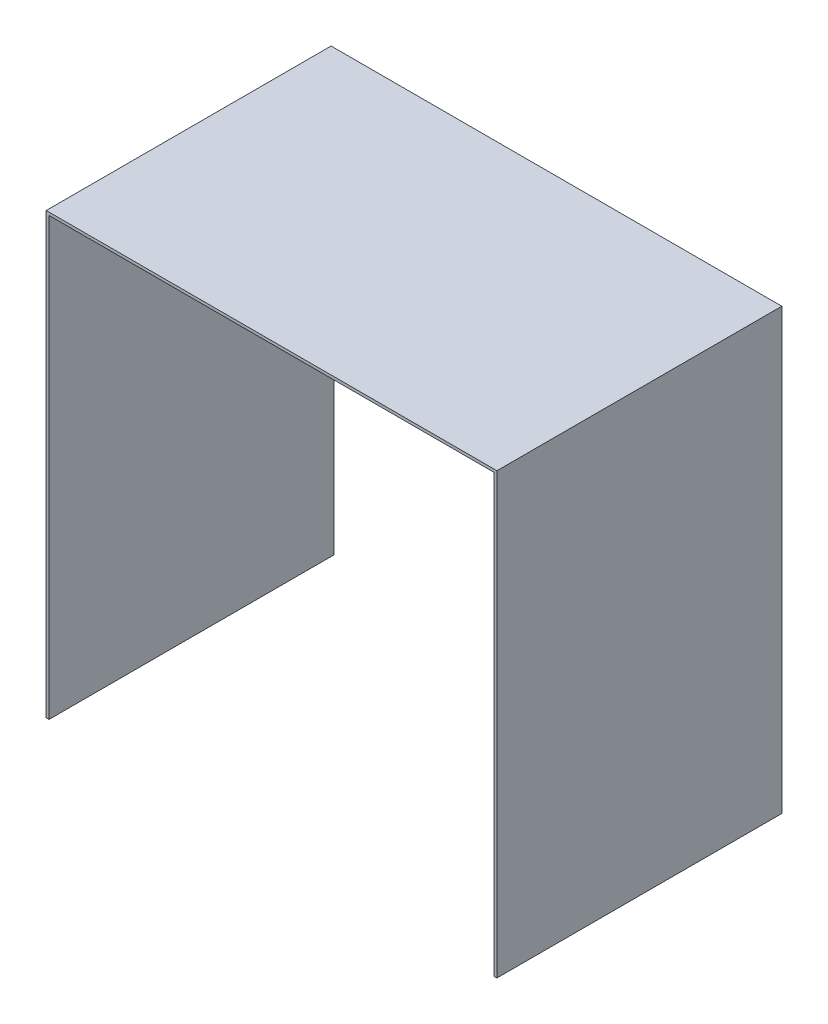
ISO-10303-21;
HEADER;
FILE_DESCRIPTION(('STEP AP214'),'2;1');
FILE_NAME('part.step','',(''),(''),'','','');
FILE_SCHEMA(('AUTOMOTIVE_DESIGN { 1 0 10303 214 1 1 1 1 }'));
ENDSEC;
DATA;
#1=APPLICATION_CONTEXT('core data for automotive mechanical design processes');
#2=APPLICATION_PROTOCOL_DEFINITION('international standard','automotive_design',2000,#1);
#3=PRODUCT_CONTEXT('',#1,'mechanical');
#4=PRODUCT('Part','Part','',(#3));
#5=PRODUCT_RELATED_PRODUCT_CATEGORY('part','',(#4));
#6=PRODUCT_DEFINITION_FORMATION('','',#4);
#7=PRODUCT_DEFINITION_CONTEXT('part definition',#1,'design');
#8=PRODUCT_DEFINITION('design','',#6,#7);
#9=PRODUCT_DEFINITION_SHAPE('','',#8);
#10=(LENGTH_UNIT() NAMED_UNIT(*) SI_UNIT(.MILLI.,.METRE.));
#11=(NAMED_UNIT(*) PLANE_ANGLE_UNIT() SI_UNIT($,.RADIAN.));
#12=(NAMED_UNIT(*) SI_UNIT($,.STERADIAN.) SOLID_ANGLE_UNIT());
#13=UNCERTAINTY_MEASURE_WITH_UNIT(LENGTH_MEASURE(1.E-05),#10,'distance_accuracy_value','');
#14=(GEOMETRIC_REPRESENTATION_CONTEXT(3) GLOBAL_UNCERTAINTY_ASSIGNED_CONTEXT((#13)) GLOBAL_UNIT_ASSIGNED_CONTEXT((#10,
#11,#12)) REPRESENTATION_CONTEXT('',''));
#15=CARTESIAN_POINT('',(0.,0.,0.));
#16=DIRECTION('',(0.,0.,1.));
#17=DIRECTION('',(1.,0.,0.));
#18=AXIS2_PLACEMENT_3D('',#15,#16,#17);
#19=CARTESIAN_POINT('',(-10.,0.,1000.));
#20=DIRECTION('',(1.,0.,0.));
#21=DIRECTION('',(0.,0.,-1.));
#22=AXIS2_PLACEMENT_3D('',#19,#20,#21);
#23=PLANE('',#22);
#24=DIRECTION('',(0.,1.,0.));
#25=VECTOR('',#24,1.);
#26=CARTESIAN_POINT('',(-10.,0.,0.));
#27=LINE('',#26,#25);
#28=CARTESIAN_POINT('',(-10.,1542.,0.));
#29=VERTEX_POINT('',#28);
#30=CARTESIAN_POINT('',(-10.,0.,0.));
#31=VERTEX_POINT('',#30);
#32=EDGE_CURVE('E106',#29,#31,#27,.F.);
#33=ORIENTED_EDGE('',*,*,#32,.T.);
#34=DIRECTION('',(0.,0.,-1.));
#35=VECTOR('',#34,1.);
#36=CARTESIAN_POINT('',(-10.,0.,1000.));
#37=LINE('',#36,#35);
#38=CARTESIAN_POINT('',(-10.,0.,1000.));
#39=VERTEX_POINT('',#38);
#40=EDGE_CURVE('E11',#39,#31,#37,.T.);
#41=ORIENTED_EDGE('',*,*,#40,.F.);
#42=DIRECTION('',(0.,1.,0.));
#43=VECTOR('',#42,1.);
#44=CARTESIAN_POINT('',(-10.,0.,1000.));
#45=LINE('',#44,#43);
#46=CARTESIAN_POINT('',(-10.,1542.,1000.));
#47=VERTEX_POINT('',#46);
#48=EDGE_CURVE('E130',#47,#39,#45,.F.);
#49=ORIENTED_EDGE('',*,*,#48,.F.);
#50=DIRECTION('',(0.,0.,-1.));
#51=VECTOR('',#50,1.);
#52=CARTESIAN_POINT('',(-10.,1542.,1000.));
#53=LINE('',#52,#51);
#54=EDGE_CURVE('E107',#47,#29,#53,.T.);
#55=ORIENTED_EDGE('',*,*,#54,.T.);
#56=EDGE_LOOP('',(#33,#41,#49,#55));
#57=FACE_BOUND('',#56,.T.);
#58=ADVANCED_FACE('F31',(#57),#23,.F.);
#59=CARTESIAN_POINT('',(0.,0.,1000.));
#60=DIRECTION('',(0.,-1.,0.));
#61=DIRECTION('',(0.,0.,-1.));
#62=AXIS2_PLACEMENT_3D('',#59,#60,#61);
#63=PLANE('',#62);
#64=DIRECTION('',(-1.,0.,0.));
#65=VECTOR('',#64,1.);
#66=CARTESIAN_POINT('',(0.,0.,0.));
#67=LINE('',#66,#65);
#68=CARTESIAN_POINT('',(0.,0.,0.));
#69=VERTEX_POINT('',#68);
#70=EDGE_CURVE('E98',#69,#31,#67,.T.);
#71=ORIENTED_EDGE('',*,*,#70,.F.);
#72=DIRECTION('',(0.,0.,-1.));
#73=VECTOR('',#72,1.);
#74=CARTESIAN_POINT('',(0.,0.,1000.));
#75=LINE('',#74,#73);
#76=CARTESIAN_POINT('',(0.,0.,1000.));
#77=VERTEX_POINT('',#76);
#78=EDGE_CURVE('E38',#77,#69,#75,.T.);
#79=ORIENTED_EDGE('',*,*,#78,.F.);
#80=DIRECTION('',(-1.,0.,0.));
#81=VECTOR('',#80,1.);
#82=CARTESIAN_POINT('',(0.,0.,1000.));
#83=LINE('',#82,#81);
#84=EDGE_CURVE('E101',#77,#39,#83,.T.);
#85=ORIENTED_EDGE('',*,*,#84,.T.);
#86=ORIENTED_EDGE('',*,*,#40,.T.);
#87=EDGE_LOOP('',(#71,#79,#85,#86));
#88=FACE_BOUND('',#87,.T.);
#89=ADVANCED_FACE('F96',(#88),#63,.T.);
#90=CARTESIAN_POINT('',(0.,0.,1000.));
#91=DIRECTION('',(1.,0.,0.));
#92=DIRECTION('',(0.,0.,-1.));
#93=AXIS2_PLACEMENT_3D('',#90,#91,#92);
#94=PLANE('',#93);
#95=DIRECTION('',(0.,-1.,0.));
#96=VECTOR('',#95,1.);
#97=CARTESIAN_POINT('',(0.,0.,0.));
#98=LINE('',#97,#96);
#99=CARTESIAN_POINT('',(0.,1532.,0.));
#100=VERTEX_POINT('',#99);
#101=EDGE_CURVE('E114',#100,#69,#98,.T.);
#102=ORIENTED_EDGE('',*,*,#101,.F.);
#103=DIRECTION('',(0.,0.,-1.));
#104=VECTOR('',#103,1.);
#105=CARTESIAN_POINT('',(0.,1532.,1000.));
#106=LINE('',#105,#104);
#107=CARTESIAN_POINT('',(0.,1532.,1000.));
#108=VERTEX_POINT('',#107);
#109=EDGE_CURVE('E157',#108,#100,#106,.T.);
#110=ORIENTED_EDGE('',*,*,#109,.F.);
#111=DIRECTION('',(0.,-1.,0.));
#112=VECTOR('',#111,1.);
#113=CARTESIAN_POINT('',(0.,0.,1000.));
#114=LINE('',#113,#112);
#115=EDGE_CURVE('E133',#108,#77,#114,.T.);
#116=ORIENTED_EDGE('',*,*,#115,.T.);
#117=ORIENTED_EDGE('',*,*,#78,.T.);
#118=EDGE_LOOP('',(#102,#110,#116,#117));
#119=FACE_BOUND('',#118,.T.);
#120=ADVANCED_FACE('F159',(#119),#94,.T.);
#121=CARTESIAN_POINT('',(0.,1532.,1000.));
#122=DIRECTION('',(0.,-1.,0.));
#123=DIRECTION('',(0.,0.,-1.));
#124=AXIS2_PLACEMENT_3D('',#121,#122,#123);
#125=PLANE('',#124);
#126=DIRECTION('',(-1.,0.,0.));
#127=VECTOR('',#126,1.);
#128=CARTESIAN_POINT('',(0.,1532.,0.));
#129=LINE('',#128,#127);
#130=CARTESIAN_POINT('',(1562.,1532.,0.));
#131=VERTEX_POINT('',#130);
#132=EDGE_CURVE('E116',#131,#100,#129,.T.);
#133=ORIENTED_EDGE('',*,*,#132,.F.);
#134=DIRECTION('',(0.,0.,-1.));
#135=VECTOR('',#134,1.);
#136=CARTESIAN_POINT('',(1562.,1532.,1000.));
#137=LINE('',#136,#135);
#138=CARTESIAN_POINT('',(1562.,1532.,1000.));
#139=VERTEX_POINT('',#138);
#140=EDGE_CURVE('E155',#139,#131,#137,.T.);
#141=ORIENTED_EDGE('',*,*,#140,.F.);
#142=DIRECTION('',(-1.,0.,0.));
#143=VECTOR('',#142,1.);
#144=CARTESIAN_POINT('',(0.,1532.,1000.));
#145=LINE('',#144,#143);
#146=EDGE_CURVE('E136',#139,#108,#145,.T.);
#147=ORIENTED_EDGE('',*,*,#146,.T.);
#148=ORIENTED_EDGE('',*,*,#109,.T.);
#149=EDGE_LOOP('',(#133,#141,#147,#148));
#150=FACE_BOUND('',#149,.T.);
#151=ADVANCED_FACE('F166',(#150),#125,.T.);
#152=CARTESIAN_POINT('',(1562.,0.,1000.));
#153=DIRECTION('',(-1.,0.,0.));
#154=DIRECTION('',(0.,0.,1.));
#155=AXIS2_PLACEMENT_3D('',#152,#153,#154);
#156=PLANE('',#155);
#157=DIRECTION('',(0.,1.,0.));
#158=VECTOR('',#157,1.);
#159=CARTESIAN_POINT('',(1562.,0.,0.));
#160=LINE('',#159,#158);
#161=CARTESIAN_POINT('',(1562.,0.,0.));
#162=VERTEX_POINT('',#161);
#163=EDGE_CURVE('E120',#162,#131,#160,.T.);
#164=ORIENTED_EDGE('',*,*,#163,.F.);
#165=DIRECTION('',(0.,0.,-1.));
#166=VECTOR('',#165,1.);
#167=CARTESIAN_POINT('',(1562.,0.,1000.));
#168=LINE('',#167,#166);
#169=CARTESIAN_POINT('',(1562.,0.,1000.));
#170=VERTEX_POINT('',#169);
#171=EDGE_CURVE('E153',#170,#162,#168,.T.);
#172=ORIENTED_EDGE('',*,*,#171,.F.);
#173=DIRECTION('',(0.,1.,0.));
#174=VECTOR('',#173,1.);
#175=CARTESIAN_POINT('',(1562.,0.,1000.));
#176=LINE('',#175,#174);
#177=EDGE_CURVE('E139',#170,#139,#176,.T.);
#178=ORIENTED_EDGE('',*,*,#177,.T.);
#179=ORIENTED_EDGE('',*,*,#140,.T.);
#180=EDGE_LOOP('',(#164,#172,#178,#179));
#181=FACE_BOUND('',#180,.T.);
#182=ADVANCED_FACE('F169',(#181),#156,.T.);
#183=CARTESIAN_POINT('',(1572.,0.,1000.));
#184=DIRECTION('',(0.,-1.,0.));
#185=DIRECTION('',(0.,0.,-1.));
#186=AXIS2_PLACEMENT_3D('',#183,#184,#185);
#187=PLANE('',#186);
#188=DIRECTION('',(-1.,0.,0.));
#189=VECTOR('',#188,1.);
#190=CARTESIAN_POINT('',(1572.,0.,0.));
#191=LINE('',#190,#189);
#192=CARTESIAN_POINT('',(1572.,0.,0.));
#193=VERTEX_POINT('',#192);
#194=EDGE_CURVE('E123',#193,#162,#191,.T.);
#195=ORIENTED_EDGE('',*,*,#194,.F.);
#196=DIRECTION('',(0.,0.,-1.));
#197=VECTOR('',#196,1.);
#198=CARTESIAN_POINT('',(1572.,0.,1000.));
#199=LINE('',#198,#197);
#200=CARTESIAN_POINT('',(1572.,0.,1000.));
#201=VERTEX_POINT('',#200);
#202=EDGE_CURVE('E151',#201,#193,#199,.T.);
#203=ORIENTED_EDGE('',*,*,#202,.F.);
#204=DIRECTION('',(-1.,0.,0.));
#205=VECTOR('',#204,1.);
#206=CARTESIAN_POINT('',(1572.,0.,1000.));
#207=LINE('',#206,#205);
#208=EDGE_CURVE('E142',#201,#170,#207,.T.);
#209=ORIENTED_EDGE('',*,*,#208,.T.);
#210=ORIENTED_EDGE('',*,*,#171,.T.);
#211=EDGE_LOOP('',(#195,#203,#209,#210));
#212=FACE_BOUND('',#211,.T.);
#213=ADVANCED_FACE('F172',(#212),#187,.T.);
#214=CARTESIAN_POINT('',(1572.,0.,1000.));
#215=DIRECTION('',(-1.,0.,0.));
#216=DIRECTION('',(0.,0.,1.));
#217=AXIS2_PLACEMENT_3D('',#214,#215,#216);
#218=PLANE('',#217);
#219=DIRECTION('',(0.,1.,0.));
#220=VECTOR('',#219,1.);
#221=CARTESIAN_POINT('',(1572.,0.,0.));
#222=LINE('',#221,#220);
#223=CARTESIAN_POINT('',(1572.,1542.,0.));
#224=VERTEX_POINT('',#223);
#225=EDGE_CURVE('E126',#193,#224,#222,.T.);
#226=ORIENTED_EDGE('',*,*,#225,.T.);
#227=DIRECTION('',(0.,0.,-1.));
#228=VECTOR('',#227,1.);
#229=CARTESIAN_POINT('',(1572.,1542.,1000.));
#230=LINE('',#229,#228);
#231=CARTESIAN_POINT('',(1572.,1542.,1000.));
#232=VERTEX_POINT('',#231);
#233=EDGE_CURVE('E148',#232,#224,#230,.T.);
#234=ORIENTED_EDGE('',*,*,#233,.F.);
#235=DIRECTION('',(0.,1.,0.));
#236=VECTOR('',#235,1.);
#237=CARTESIAN_POINT('',(1572.,0.,1000.));
#238=LINE('',#237,#236);
#239=EDGE_CURVE('E50',#201,#232,#238,.T.);
#240=ORIENTED_EDGE('',*,*,#239,.F.);
#241=ORIENTED_EDGE('',*,*,#202,.T.);
#242=EDGE_LOOP('',(#226,#234,#240,#241));
#243=FACE_BOUND('',#242,.T.);
#244=ADVANCED_FACE('F175',(#243),#218,.F.);
#245=CARTESIAN_POINT('',(0.,1542.,1000.));
#246=DIRECTION('',(0.,-1.,0.));
#247=DIRECTION('',(0.,0.,-1.));
#248=AXIS2_PLACEMENT_3D('',#245,#246,#247);
#249=PLANE('',#248);
#250=DIRECTION('',(1.,0.,0.));
#251=VECTOR('',#250,1.);
#252=CARTESIAN_POINT('',(0.,1542.,0.));
#253=LINE('',#252,#251);
#254=EDGE_CURVE('E128',#224,#29,#253,.F.);
#255=ORIENTED_EDGE('',*,*,#254,.T.);
#256=ORIENTED_EDGE('',*,*,#54,.F.);
#257=DIRECTION('',(1.,0.,0.));
#258=VECTOR('',#257,1.);
#259=CARTESIAN_POINT('',(0.,1542.,1000.));
#260=LINE('',#259,#258);
#261=EDGE_CURVE('E45',#232,#47,#260,.F.);
#262=ORIENTED_EDGE('',*,*,#261,.F.);
#263=ORIENTED_EDGE('',*,*,#233,.T.);
#264=EDGE_LOOP('',(#255,#256,#262,#263));
#265=FACE_BOUND('',#264,.T.);
#266=ADVANCED_FACE('F177',(#265),#249,.F.);
#267=CARTESIAN_POINT('',(-10.,0.,1000.));
#268=DIRECTION('',(0.,0.,1.));
#269=DIRECTION('',(1.,0.,0.));
#270=AXIS2_PLACEMENT_3D('',#267,#268,#269);
#271=PLANE('',#270);
#272=ORIENTED_EDGE('',*,*,#48,.T.);
#273=ORIENTED_EDGE('',*,*,#84,.F.);
#274=ORIENTED_EDGE('',*,*,#115,.F.);
#275=ORIENTED_EDGE('',*,*,#146,.F.);
#276=ORIENTED_EDGE('',*,*,#177,.F.);
#277=ORIENTED_EDGE('',*,*,#208,.F.);
#278=ORIENTED_EDGE('',*,*,#239,.T.);
#279=ORIENTED_EDGE('',*,*,#261,.T.);
#280=EDGE_LOOP('',(#272,#273,#274,#275,#276,#277,#278,#279));
#281=FACE_BOUND('',#280,.T.);
#282=ADVANCED_FACE('F161',(#281),#271,.T.);
#283=CARTESIAN_POINT('',(-10.,0.,0.));
#284=DIRECTION('',(0.,0.,1.));
#285=DIRECTION('',(1.,0.,0.));
#286=AXIS2_PLACEMENT_3D('',#283,#284,#285);
#287=PLANE('',#286);
#288=ORIENTED_EDGE('',*,*,#32,.F.);
#289=ORIENTED_EDGE('',*,*,#254,.F.);
#290=ORIENTED_EDGE('',*,*,#225,.F.);
#291=ORIENTED_EDGE('',*,*,#194,.T.);
#292=ORIENTED_EDGE('',*,*,#163,.T.);
#293=ORIENTED_EDGE('',*,*,#132,.T.);
#294=ORIENTED_EDGE('',*,*,#101,.T.);
#295=ORIENTED_EDGE('',*,*,#70,.T.);
#296=EDGE_LOOP('',(#288,#289,#290,#291,#292,#293,#294,#295));
#297=FACE_BOUND('',#296,.T.);
#298=ADVANCED_FACE('F111',(#297),#287,.F.);
#299=CLOSED_SHELL('',(#58,#89,#120,#151,#182,#213,#244,#266,#282,#298));
#300=MANIFOLD_SOLID_BREP('B2',#299);
#301=ADVANCED_BREP_SHAPE_REPRESENTATION('',(#18,#300),#14);
#302=SHAPE_DEFINITION_REPRESENTATION(#9,#301);
ENDSEC;
END-ISO-10303-21;
